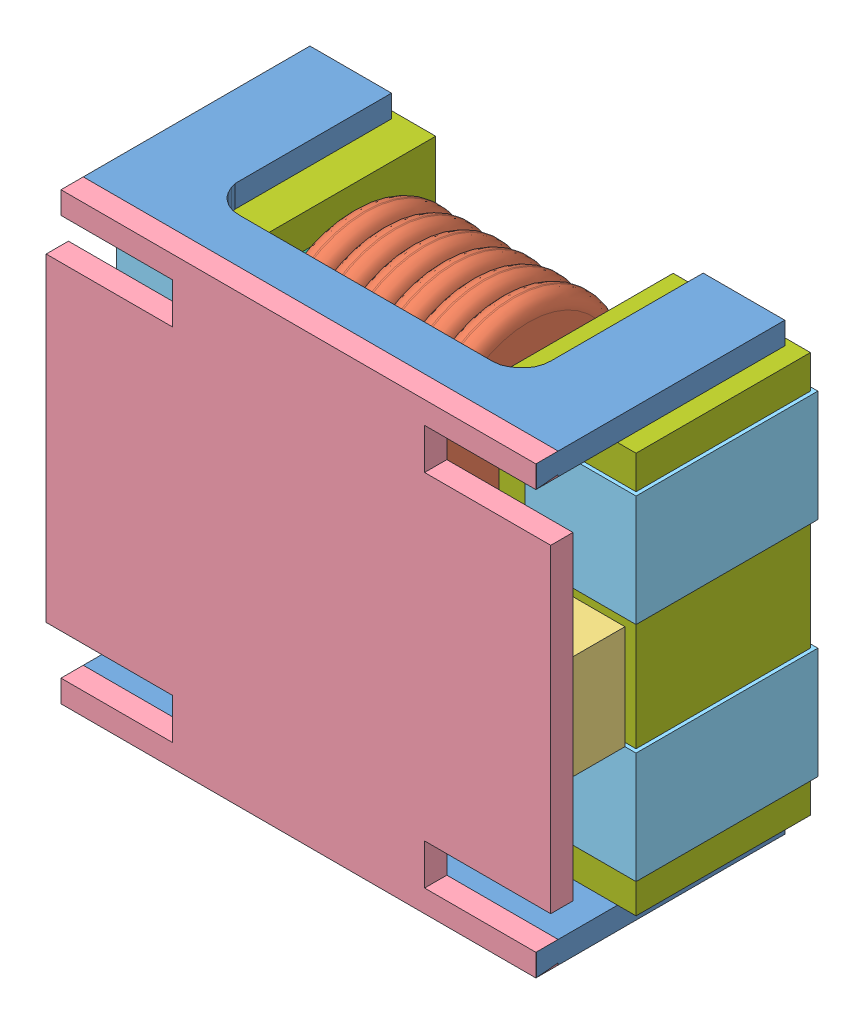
SolidWorks assembly User Library-ACM70V.sldasm, configuration Default (file format 13000). Lengths in mm.
Overall size (7 6 3.5).
37 component instances, 7 part files, 0 mates.
Components (placement in the parent):
- User Library-ACM70V_Free-Models-1: User Library-ACM70V_Free-Models.SLDASM [Default] at origin size (7 6 3.5)
  - User Library-ACM70V_685967776-1: User Library-ACM70V_685967776.SLDASM [Default] at (2.75 4.5 1.82) x (1 0 0) z (0 -1 0) size (6.4 3.35 0.3)
    - User Library-ACM70V_Extruded-1: User Library-ACM70V_Extruded.sldprt [Default] at origin size (6.4 3.35 0.3)
  - User Library-ACM70V_685967776-2: User Library-ACM70V_685967776.SLDASM [Default] at (2.75 -1.2 1.82) x (1 0 0) z (0 -1 0) size (6.4 3.35 0.3)
    - User Library-ACM70V_Extruded-1: User Library-ACM70V_Extruded.sldprt [Default] at origin size (6.4 3.35 0.3)
  - User Library-ACM70V_CIL-1: User Library-ACM70V_CIL.sldprt [Default] at (1.75 3 1.6) size (0.4 2.8 2.8)
  - User Library-ACM70V_CIL-2: User Library-ACM70V_CIL.sldprt [Default] at (2.15 3 1.6) size (0.4 2.8 2.8)
  - User Library-ACM70V_CIL-3: User Library-ACM70V_CIL.sldprt [Default] at (2.55 3 1.6) size (0.4 2.8 2.8)
  - User Library-ACM70V_CIL-4: User Library-ACM70V_CIL.sldprt [Default] at (2.95 3 1.6) size (0.4 2.8 2.8)
  - User Library-ACM70V_CIL-5: User Library-ACM70V_CIL.sldprt [Default] at (3.35 3 1.6) size (0.4 2.8 2.8)
  - User Library-ACM70V_CIL-6: User Library-ACM70V_CIL.sldprt [Default] at (3.75 3 1.6) size (0.4 2.8 2.8)
  - User Library-ACM70V_CIL-7: User Library-ACM70V_CIL.sldprt [Default] at (3.75 0 1.6) size (0.4 2.8 2.8)
  - User Library-ACM70V_CIL-8: User Library-ACM70V_CIL.sldprt [Default] at (3.35 0 1.6) size (0.4 2.8 2.8)
  - User Library-ACM70V_CIL-9: User Library-ACM70V_CIL.sldprt [Default] at (2.95 0 1.6) size (0.4 2.8 2.8)
  - User Library-ACM70V_CIL-10: User Library-ACM70V_CIL.sldprt [Default] at (2.55 0 1.6) size (0.4 2.8 2.8)
  - User Library-ACM70V_CIL-11: User Library-ACM70V_CIL.sldprt [Default] at (2.15 0 1.6) size (0.4 2.8 2.8)
  - User Library-ACM70V_CIL-12: User Library-ACM70V_CIL.sldprt [Default] at (1.75 0 1.6) size (0.4 2.8 2.8)
  - User Library-ACM70V_693680304-1: User Library-ACM70V_693680304.SLDASM [Default] at (2.75 1.5 2.5) size (6.8 1.4 0.7)
    - User Library-ACM70V_Extruded_2-1: User Library-ACM70V_Extruded_2.sldprt [Default] at origin size (6.8 1.4 0.7)
  - User Library-ACM70V_693673904-1: User Library-ACM70V_693673904.SLDASM [Default] at (2.75 1.5 3.2) size (6.8 6 0.3)
    - User Library-ACM70V_Extruded_3-1: User Library-ACM70V_Extruded_3.sldprt [Default] at origin size (6.8 6 0.3)
  - User Library-ACM70V_693681328-1: User Library-ACM70V_693681328.SLDASM [Default] at (5.5 0 0) size (1.5 1.5 2.45)
    - User Library-ACM70V_Extruded_4-1: User Library-ACM70V_Extruded_4.sldprt [Default] at origin size (1.5 1.5 2.45)
  - User Library-ACM70V_693681328-2: User Library-ACM70V_693681328.SLDASM [Default] at (5.5 3 0) size (1.5 1.5 2.45)
    - User Library-ACM70V_Extruded_4-1: User Library-ACM70V_Extruded_4.sldprt [Default] at origin size (1.5 1.5 2.45)
  - User Library-ACM70V_693681328-3: User Library-ACM70V_693681328.SLDASM [Default] at origin size (1.5 1.5 2.45)
    - User Library-ACM70V_Extruded_4-1: User Library-ACM70V_Extruded_4.sldprt [Default] at origin size (1.5 1.5 2.45)
  - User Library-ACM70V_693681328-4: User Library-ACM70V_693681328.SLDASM [Default] at (0 3 0) size (1.5 1.5 2.45)
    - User Library-ACM70V_Extruded_4-1: User Library-ACM70V_Extruded_4.sldprt [Default] at origin size (1.5 1.5 2.45)
  - User Library-ACM70V_693662384-1: User Library-ACM70V_693662384.SLDASM [Default] at (2.75 0 0.7) size (3.2 1.5 1.3)
    - User Library-ACM70V_Extruded_5-1: User Library-ACM70V_Extruded_5.sldprt [Default] at origin size (3.2 1.5 1.3)
  - User Library-ACM70V_693662384-2: User Library-ACM70V_693662384.SLDASM [Default] at (2.75 3 0.7) size (3.2 1.5 1.3)
    - User Library-ACM70V_Extruded_5-1: User Library-ACM70V_Extruded_5.sldprt [Default] at origin size (3.2 1.5 1.3)
  - User Library-ACM70V_693658288-1: User Library-ACM70V_693658288.SLDASM [Default] at (5.275 1.5 0.05) size (1.85 5.4 2.35)
    - User Library-ACM70V_Extruded_6-1: User Library-ACM70V_Extruded_6.sldprt [Default] at origin size (1.85 5.4 2.35)
  - User Library-ACM70V_693658288-2: User Library-ACM70V_693658288.SLDASM [Default] at (0.225 1.5 0.05) size (1.85 5.4 2.35)
    - User Library-ACM70V_Extruded_6-1: User Library-ACM70V_Extruded_6.sldprt [Default] at origin size (1.85 5.4 2.35)
